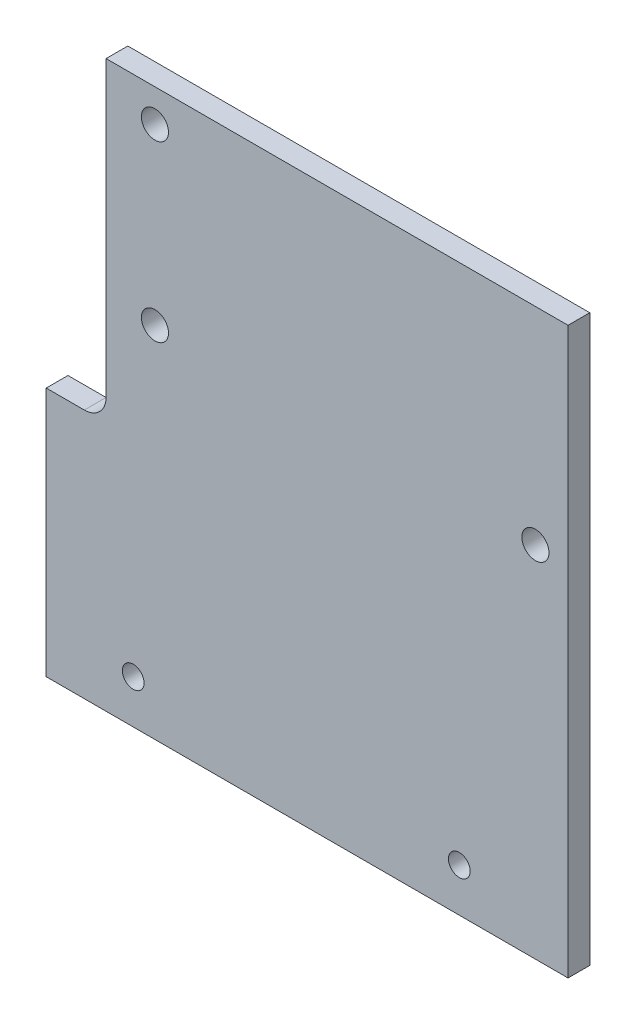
ISO-10303-21;
HEADER;
FILE_DESCRIPTION(('STEP AP214'),'2;1');
FILE_NAME('part.step','',(''),(''),'','','');
FILE_SCHEMA(('AUTOMOTIVE_DESIGN { 1 0 10303 214 1 1 1 1 }'));
ENDSEC;
DATA;
#1=APPLICATION_CONTEXT('core data for automotive mechanical design processes');
#2=APPLICATION_PROTOCOL_DEFINITION('international standard','automotive_design',2000,#1);
#3=PRODUCT_CONTEXT('',#1,'mechanical');
#4=PRODUCT('Part','Part','',(#3));
#5=PRODUCT_RELATED_PRODUCT_CATEGORY('part','',(#4));
#6=PRODUCT_DEFINITION_FORMATION('','',#4);
#7=PRODUCT_DEFINITION_CONTEXT('part definition',#1,'design');
#8=PRODUCT_DEFINITION('design','',#6,#7);
#9=PRODUCT_DEFINITION_SHAPE('','',#8);
#10=(LENGTH_UNIT() NAMED_UNIT(*) SI_UNIT(.MILLI.,.METRE.));
#11=(NAMED_UNIT(*) PLANE_ANGLE_UNIT() SI_UNIT($,.RADIAN.));
#12=(NAMED_UNIT(*) SI_UNIT($,.STERADIAN.) SOLID_ANGLE_UNIT());
#13=UNCERTAINTY_MEASURE_WITH_UNIT(LENGTH_MEASURE(1.E-05),#10,'distance_accuracy_value','');
#14=(GEOMETRIC_REPRESENTATION_CONTEXT(3) GLOBAL_UNCERTAINTY_ASSIGNED_CONTEXT((#13)) GLOBAL_UNIT_ASSIGNED_CONTEXT((#10,
#11,#12)) REPRESENTATION_CONTEXT('',''));
#15=CARTESIAN_POINT('',(0.,0.,0.));
#16=DIRECTION('',(0.,0.,1.));
#17=DIRECTION('',(1.,0.,0.));
#18=AXIS2_PLACEMENT_3D('',#15,#16,#17);
#19=CARTESIAN_POINT('',(0.,0.,6.35));
#20=DIRECTION('',(0.,0.,1.));
#21=DIRECTION('',(1.,0.,0.));
#22=AXIS2_PLACEMENT_3D('',#19,#20,#21);
#23=PLANE('',#22);
#24=CARTESIAN_POINT('',(25.4,12.7,6.35));
#25=DIRECTION('',(0.,0.,1.));
#26=DIRECTION('',(1.,0.,0.));
#27=AXIS2_PLACEMENT_3D('',#24,#25,#26);
#28=CIRCLE('',#27,3.175);
#29=CARTESIAN_POINT('',(28.575,12.7,6.35));
#30=VERTEX_POINT('',#29);
#31=EDGE_CURVE('E163',#30,#30,#28,.T.);
#32=ORIENTED_EDGE('',*,*,#31,.F.);
#33=EDGE_LOOP('',(#32));
#34=FACE_BOUND('',#33,.T.);
#35=CARTESIAN_POINT('',(31.75,104.775,6.35));
#36=DIRECTION('',(0.,0.,1.));
#37=DIRECTION('',(1.,0.,0.));
#38=AXIS2_PLACEMENT_3D('',#35,#36,#37);
#39=CIRCLE('',#38,3.96239999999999);
#40=CARTESIAN_POINT('',(35.7124,104.775,6.35));
#41=VERTEX_POINT('',#40);
#42=EDGE_CURVE('E151',#41,#41,#39,.T.);
#43=ORIENTED_EDGE('',*,*,#42,.F.);
#44=EDGE_LOOP('',(#43));
#45=FACE_BOUND('',#44,.T.);
#46=DIRECTION('',(0.,1.,0.));
#47=VECTOR('',#46,1.);
#48=CARTESIAN_POINT('',(152.4,0.,6.35));
#49=LINE('',#48,#47);
#50=CARTESIAN_POINT('',(152.4,0.,6.35));
#51=VERTEX_POINT('',#50);
#52=CARTESIAN_POINT('',(152.4,165.1,6.35));
#53=VERTEX_POINT('',#52);
#54=EDGE_CURVE('E102',#51,#53,#49,.T.);
#55=ORIENTED_EDGE('',*,*,#54,.T.);
#56=DIRECTION('',(-1.,0.,0.));
#57=VECTOR('',#56,1.);
#58=CARTESIAN_POINT('',(152.4,165.1,6.35));
#59=LINE('',#58,#57);
#60=CARTESIAN_POINT('',(17.4752,165.1,6.35));
#61=VERTEX_POINT('',#60);
#62=EDGE_CURVE('E92',#53,#61,#59,.T.);
#63=ORIENTED_EDGE('',*,*,#62,.T.);
#64=DIRECTION('',(0.,-1.,0.));
#65=VECTOR('',#64,1.);
#66=CARTESIAN_POINT('',(17.4752,165.1,6.35));
#67=LINE('',#66,#65);
#68=CARTESIAN_POINT('',(17.4752,79.375,6.35));
#69=VERTEX_POINT('',#68);
#70=EDGE_CURVE('E101',#61,#69,#67,.T.);
#71=ORIENTED_EDGE('',*,*,#70,.T.);
#72=CARTESIAN_POINT('',(11.1252,79.375,6.35));
#73=DIRECTION('',(0.,0.,1.));
#74=DIRECTION('',(1.,0.,0.));
#75=AXIS2_PLACEMENT_3D('',#72,#73,#74);
#76=CIRCLE('',#75,6.35);
#77=CARTESIAN_POINT('',(11.1252,73.025,6.35));
#78=VERTEX_POINT('',#77);
#79=EDGE_CURVE('E11',#69,#78,#76,.F.);
#80=ORIENTED_EDGE('',*,*,#79,.T.);
#81=DIRECTION('',(-1.,0.,0.));
#82=VECTOR('',#81,1.);
#83=CARTESIAN_POINT('',(17.4752,73.025,6.35));
#84=LINE('',#83,#82);
#85=CARTESIAN_POINT('',(0.,73.025,6.35));
#86=VERTEX_POINT('',#85);
#87=EDGE_CURVE('E145',#78,#86,#84,.T.);
#88=ORIENTED_EDGE('',*,*,#87,.T.);
#89=DIRECTION('',(0.,-1.,0.));
#90=VECTOR('',#89,1.);
#91=CARTESIAN_POINT('',(0.,73.025,6.35));
#92=LINE('',#91,#90);
#93=CARTESIAN_POINT('',(0.,0.,6.35));
#94=VERTEX_POINT('',#93);
#95=EDGE_CURVE('E143',#86,#94,#92,.T.);
#96=ORIENTED_EDGE('',*,*,#95,.T.);
#97=DIRECTION('',(1.,0.,0.));
#98=VECTOR('',#97,1.);
#99=CARTESIAN_POINT('',(0.,0.,6.35));
#100=LINE('',#99,#98);
#101=EDGE_CURVE('E107',#94,#51,#100,.T.);
#102=ORIENTED_EDGE('',*,*,#101,.T.);
#103=EDGE_LOOP('',(#55,#63,#71,#80,#88,#96,#102));
#104=FACE_BOUND('',#103,.T.);
#105=CARTESIAN_POINT('',(31.75,155.575,6.35));
#106=DIRECTION('',(0.,0.,1.));
#107=DIRECTION('',(1.,0.,0.));
#108=AXIS2_PLACEMENT_3D('',#105,#106,#107);
#109=CIRCLE('',#108,3.9624);
#110=CARTESIAN_POINT('',(35.7124,155.575,6.35));
#111=VERTEX_POINT('',#110);
#112=EDGE_CURVE('E141',#111,#111,#109,.T.);
#113=ORIENTED_EDGE('',*,*,#112,.F.);
#114=EDGE_LOOP('',(#113));
#115=FACE_BOUND('',#114,.T.);
#116=CARTESIAN_POINT('',(142.875,104.775,6.35));
#117=DIRECTION('',(0.,0.,1.));
#118=DIRECTION('',(1.,0.,0.));
#119=AXIS2_PLACEMENT_3D('',#116,#117,#118);
#120=CIRCLE('',#119,3.9624);
#121=CARTESIAN_POINT('',(146.8374,104.775,6.35));
#122=VERTEX_POINT('',#121);
#123=EDGE_CURVE('E157',#122,#122,#120,.T.);
#124=ORIENTED_EDGE('',*,*,#123,.F.);
#125=EDGE_LOOP('',(#124));
#126=FACE_BOUND('',#125,.T.);
#127=CARTESIAN_POINT('',(120.65,12.7,6.35));
#128=DIRECTION('',(0.,0.,1.));
#129=DIRECTION('',(1.,0.,0.));
#130=AXIS2_PLACEMENT_3D('',#127,#128,#129);
#131=CIRCLE('',#130,3.175);
#132=CARTESIAN_POINT('',(123.825,12.7,6.35));
#133=VERTEX_POINT('',#132);
#134=EDGE_CURVE('E169',#133,#133,#131,.T.);
#135=ORIENTED_EDGE('',*,*,#134,.F.);
#136=EDGE_LOOP('',(#135));
#137=FACE_BOUND('',#136,.T.);
#138=ADVANCED_FACE('F33',(#34,#45,#104,#115,#126,#137),#23,.T.);
#139=CARTESIAN_POINT('',(0.,0.,0.));
#140=DIRECTION('',(0.,0.,1.));
#141=DIRECTION('',(1.,0.,0.));
#142=AXIS2_PLACEMENT_3D('',#139,#140,#141);
#143=PLANE('',#142);
#144=CARTESIAN_POINT('',(25.4,12.7,0.));
#145=DIRECTION('',(0.,0.,1.));
#146=DIRECTION('',(1.,0.,0.));
#147=AXIS2_PLACEMENT_3D('',#144,#145,#146);
#148=CIRCLE('',#147,3.175);
#149=CARTESIAN_POINT('',(28.575,12.7,0.));
#150=VERTEX_POINT('',#149);
#151=EDGE_CURVE('E166',#150,#150,#148,.T.);
#152=ORIENTED_EDGE('',*,*,#151,.T.);
#153=EDGE_LOOP('',(#152));
#154=FACE_BOUND('',#153,.T.);
#155=CARTESIAN_POINT('',(31.75,104.775,0.));
#156=DIRECTION('',(0.,0.,1.));
#157=DIRECTION('',(1.,0.,0.));
#158=AXIS2_PLACEMENT_3D('',#155,#156,#157);
#159=CIRCLE('',#158,3.96239999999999);
#160=CARTESIAN_POINT('',(35.7124,104.775,0.));
#161=VERTEX_POINT('',#160);
#162=EDGE_CURVE('E154',#161,#161,#159,.T.);
#163=ORIENTED_EDGE('',*,*,#162,.T.);
#164=EDGE_LOOP('',(#163));
#165=FACE_BOUND('',#164,.T.);
#166=DIRECTION('',(0.,1.,0.));
#167=VECTOR('',#166,1.);
#168=CARTESIAN_POINT('',(152.4,0.,0.));
#169=LINE('',#168,#167);
#170=CARTESIAN_POINT('',(152.4,0.,0.));
#171=VERTEX_POINT('',#170);
#172=CARTESIAN_POINT('',(152.4,165.1,0.));
#173=VERTEX_POINT('',#172);
#174=EDGE_CURVE('E115',#171,#173,#169,.T.);
#175=ORIENTED_EDGE('',*,*,#174,.F.);
#176=DIRECTION('',(1.,0.,0.));
#177=VECTOR('',#176,1.);
#178=CARTESIAN_POINT('',(0.,0.,0.));
#179=LINE('',#178,#177);
#180=CARTESIAN_POINT('',(0.,0.,0.));
#181=VERTEX_POINT('',#180);
#182=EDGE_CURVE('E111',#181,#171,#179,.T.);
#183=ORIENTED_EDGE('',*,*,#182,.F.);
#184=DIRECTION('',(0.,-1.,0.));
#185=VECTOR('',#184,1.);
#186=CARTESIAN_POINT('',(0.,73.025,0.));
#187=LINE('',#186,#185);
#188=CARTESIAN_POINT('',(0.,73.025,0.));
#189=VERTEX_POINT('',#188);
#190=EDGE_CURVE('E132',#189,#181,#187,.T.);
#191=ORIENTED_EDGE('',*,*,#190,.F.);
#192=DIRECTION('',(-1.,0.,0.));
#193=VECTOR('',#192,1.);
#194=CARTESIAN_POINT('',(17.4752,73.025,0.));
#195=LINE('',#194,#193);
#196=CARTESIAN_POINT('',(11.1252,73.025,0.));
#197=VERTEX_POINT('',#196);
#198=EDGE_CURVE('E134',#197,#189,#195,.T.);
#199=ORIENTED_EDGE('',*,*,#198,.F.);
#200=CARTESIAN_POINT('',(11.1252,79.375,0.));
#201=DIRECTION('',(0.,0.,1.));
#202=DIRECTION('',(1.,0.,0.));
#203=AXIS2_PLACEMENT_3D('',#200,#201,#202);
#204=CIRCLE('',#203,6.35);
#205=CARTESIAN_POINT('',(17.4752,79.375,0.));
#206=VERTEX_POINT('',#205);
#207=EDGE_CURVE('E41',#197,#206,#204,.T.);
#208=ORIENTED_EDGE('',*,*,#207,.T.);
#209=DIRECTION('',(0.,-1.,0.));
#210=VECTOR('',#209,1.);
#211=CARTESIAN_POINT('',(17.4752,165.1,0.));
#212=LINE('',#211,#210);
#213=CARTESIAN_POINT('',(17.4752,165.1,0.));
#214=VERTEX_POINT('',#213);
#215=EDGE_CURVE('E136',#214,#206,#212,.T.);
#216=ORIENTED_EDGE('',*,*,#215,.F.);
#217=DIRECTION('',(-1.,0.,0.));
#218=VECTOR('',#217,1.);
#219=CARTESIAN_POINT('',(152.4,165.1,0.));
#220=LINE('',#219,#218);
#221=EDGE_CURVE('E138',#173,#214,#220,.T.);
#222=ORIENTED_EDGE('',*,*,#221,.F.);
#223=EDGE_LOOP('',(#175,#183,#191,#199,#208,#216,#222));
#224=FACE_BOUND('',#223,.T.);
#225=CARTESIAN_POINT('',(31.75,155.575,0.));
#226=DIRECTION('',(0.,0.,1.));
#227=DIRECTION('',(1.,0.,0.));
#228=AXIS2_PLACEMENT_3D('',#225,#226,#227);
#229=CIRCLE('',#228,3.9624);
#230=CARTESIAN_POINT('',(35.7124,155.575,0.));
#231=VERTEX_POINT('',#230);
#232=EDGE_CURVE('E148',#231,#231,#229,.T.);
#233=ORIENTED_EDGE('',*,*,#232,.T.);
#234=EDGE_LOOP('',(#233));
#235=FACE_BOUND('',#234,.T.);
#236=CARTESIAN_POINT('',(142.875,104.775,0.));
#237=DIRECTION('',(0.,0.,1.));
#238=DIRECTION('',(1.,0.,0.));
#239=AXIS2_PLACEMENT_3D('',#236,#237,#238);
#240=CIRCLE('',#239,3.9624);
#241=CARTESIAN_POINT('',(146.8374,104.775,0.));
#242=VERTEX_POINT('',#241);
#243=EDGE_CURVE('E160',#242,#242,#240,.T.);
#244=ORIENTED_EDGE('',*,*,#243,.T.);
#245=EDGE_LOOP('',(#244));
#246=FACE_BOUND('',#245,.T.);
#247=CARTESIAN_POINT('',(120.65,12.7,0.));
#248=DIRECTION('',(0.,0.,1.));
#249=DIRECTION('',(1.,0.,0.));
#250=AXIS2_PLACEMENT_3D('',#247,#248,#249);
#251=CIRCLE('',#250,3.175);
#252=CARTESIAN_POINT('',(123.825,12.7,0.));
#253=VERTEX_POINT('',#252);
#254=EDGE_CURVE('E172',#253,#253,#251,.T.);
#255=ORIENTED_EDGE('',*,*,#254,.T.);
#256=EDGE_LOOP('',(#255));
#257=FACE_BOUND('',#256,.T.);
#258=ADVANCED_FACE('F182',(#154,#165,#224,#235,#246,#257),#143,.F.);
#259=CARTESIAN_POINT('',(152.4,0.,6.35));
#260=DIRECTION('',(-1.,0.,0.));
#261=DIRECTION('',(0.,0.,1.));
#262=AXIS2_PLACEMENT_3D('',#259,#260,#261);
#263=PLANE('',#262);
#264=ORIENTED_EDGE('',*,*,#174,.T.);
#265=DIRECTION('',(0.,0.,-1.));
#266=VECTOR('',#265,1.);
#267=CARTESIAN_POINT('',(152.4,165.1,6.35));
#268=LINE('',#267,#266);
#269=EDGE_CURVE('E96',#53,#173,#268,.T.);
#270=ORIENTED_EDGE('',*,*,#269,.F.);
#271=ORIENTED_EDGE('',*,*,#54,.F.);
#272=DIRECTION('',(0.,0.,-1.));
#273=VECTOR('',#272,1.);
#274=CARTESIAN_POINT('',(152.4,0.,6.35));
#275=LINE('',#274,#273);
#276=EDGE_CURVE('E129',#51,#171,#275,.T.);
#277=ORIENTED_EDGE('',*,*,#276,.T.);
#278=EDGE_LOOP('',(#264,#270,#271,#277));
#279=FACE_BOUND('',#278,.T.);
#280=ADVANCED_FACE('F113',(#279),#263,.F.);
#281=CARTESIAN_POINT('',(152.4,165.1,6.35));
#282=DIRECTION('',(0.,-1.,0.));
#283=DIRECTION('',(1.,0.,0.));
#284=AXIS2_PLACEMENT_3D('',#281,#282,#283);
#285=PLANE('',#284);
#286=ORIENTED_EDGE('',*,*,#221,.T.);
#287=DIRECTION('',(0.,0.,-1.));
#288=VECTOR('',#287,1.);
#289=CARTESIAN_POINT('',(17.4752,165.1,6.35));
#290=LINE('',#289,#288);
#291=EDGE_CURVE('E99',#61,#214,#290,.T.);
#292=ORIENTED_EDGE('',*,*,#291,.F.);
#293=ORIENTED_EDGE('',*,*,#62,.F.);
#294=ORIENTED_EDGE('',*,*,#269,.T.);
#295=EDGE_LOOP('',(#286,#292,#293,#294));
#296=FACE_BOUND('',#295,.T.);
#297=ADVANCED_FACE('F94',(#296),#285,.F.);
#298=CARTESIAN_POINT('',(17.4752,165.1,6.35));
#299=DIRECTION('',(1.,0.,0.));
#300=DIRECTION('',(0.,1.,0.));
#301=AXIS2_PLACEMENT_3D('',#298,#299,#300);
#302=PLANE('',#301);
#303=ORIENTED_EDGE('',*,*,#215,.T.);
#304=DIRECTION('',(0.,0.,-1.));
#305=VECTOR('',#304,1.);
#306=CARTESIAN_POINT('',(17.4752,79.375,6.35));
#307=LINE('',#306,#305);
#308=EDGE_CURVE('E48',#206,#69,#307,.F.);
#309=ORIENTED_EDGE('',*,*,#308,.T.);
#310=ORIENTED_EDGE('',*,*,#70,.F.);
#311=ORIENTED_EDGE('',*,*,#291,.T.);
#312=EDGE_LOOP('',(#303,#309,#310,#311));
#313=FACE_BOUND('',#312,.T.);
#314=ADVANCED_FACE('F207',(#313),#302,.F.);
#315=CARTESIAN_POINT('',(17.4752,73.025,6.35));
#316=DIRECTION('',(0.,-1.,0.));
#317=DIRECTION('',(0.,0.,-1.));
#318=AXIS2_PLACEMENT_3D('',#315,#316,#317);
#319=PLANE('',#318);
#320=ORIENTED_EDGE('',*,*,#87,.F.);
#321=DIRECTION('',(0.,0.,-1.));
#322=VECTOR('',#321,1.);
#323=CARTESIAN_POINT('',(11.1252,73.025,0.));
#324=LINE('',#323,#322);
#325=EDGE_CURVE('E116',#78,#197,#324,.T.);
#326=ORIENTED_EDGE('',*,*,#325,.T.);
#327=ORIENTED_EDGE('',*,*,#198,.T.);
#328=DIRECTION('',(0.,0.,-1.));
#329=VECTOR('',#328,1.);
#330=CARTESIAN_POINT('',(0.,73.025,6.35));
#331=LINE('',#330,#329);
#332=EDGE_CURVE('E120',#86,#189,#331,.T.);
#333=ORIENTED_EDGE('',*,*,#332,.F.);
#334=EDGE_LOOP('',(#320,#326,#327,#333));
#335=FACE_BOUND('',#334,.T.);
#336=ADVANCED_FACE('F203',(#335),#319,.F.);
#337=CARTESIAN_POINT('',(0.,73.025,6.35));
#338=DIRECTION('',(1.,0.,0.));
#339=DIRECTION('',(0.,1.,0.));
#340=AXIS2_PLACEMENT_3D('',#337,#338,#339);
#341=PLANE('',#340);
#342=ORIENTED_EDGE('',*,*,#190,.T.);
#343=DIRECTION('',(0.,0.,-1.));
#344=VECTOR('',#343,1.);
#345=CARTESIAN_POINT('',(0.,0.,6.35));
#346=LINE('',#345,#344);
#347=EDGE_CURVE('E126',#94,#181,#346,.T.);
#348=ORIENTED_EDGE('',*,*,#347,.F.);
#349=ORIENTED_EDGE('',*,*,#95,.F.);
#350=ORIENTED_EDGE('',*,*,#332,.T.);
#351=EDGE_LOOP('',(#342,#348,#349,#350));
#352=FACE_BOUND('',#351,.T.);
#353=ADVANCED_FACE('F199',(#352),#341,.F.);
#354=CARTESIAN_POINT('',(0.,0.,6.35));
#355=DIRECTION('',(0.,1.,0.));
#356=DIRECTION('',(0.,0.,1.));
#357=AXIS2_PLACEMENT_3D('',#354,#355,#356);
#358=PLANE('',#357);
#359=ORIENTED_EDGE('',*,*,#182,.T.);
#360=ORIENTED_EDGE('',*,*,#276,.F.);
#361=ORIENTED_EDGE('',*,*,#101,.F.);
#362=ORIENTED_EDGE('',*,*,#347,.T.);
#363=EDGE_LOOP('',(#359,#360,#361,#362));
#364=FACE_BOUND('',#363,.T.);
#365=ADVANCED_FACE('F196',(#364),#358,.F.);
#366=CARTESIAN_POINT('',(31.75,155.575,6.35));
#367=DIRECTION('',(0.,0.,-1.));
#368=DIRECTION('',(-1.,0.,0.));
#369=AXIS2_PLACEMENT_3D('',#366,#367,#368);
#370=CYLINDRICAL_SURFACE('',#369,3.9624);
#371=ORIENTED_EDGE('',*,*,#112,.T.);
#372=EDGE_LOOP('',(#371));
#373=FACE_BOUND('',#372,.T.);
#374=ORIENTED_EDGE('',*,*,#232,.F.);
#375=EDGE_LOOP('',(#374));
#376=FACE_BOUND('',#375,.T.);
#377=ADVANCED_FACE('F193',(#373,#376),#370,.F.);
#378=CARTESIAN_POINT('',(31.75,104.775,6.35));
#379=DIRECTION('',(0.,0.,-1.));
#380=DIRECTION('',(-1.,0.,0.));
#381=AXIS2_PLACEMENT_3D('',#378,#379,#380);
#382=CYLINDRICAL_SURFACE('',#381,3.96239999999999);
#383=ORIENTED_EDGE('',*,*,#42,.T.);
#384=EDGE_LOOP('',(#383));
#385=FACE_BOUND('',#384,.T.);
#386=ORIENTED_EDGE('',*,*,#162,.F.);
#387=EDGE_LOOP('',(#386));
#388=FACE_BOUND('',#387,.T.);
#389=ADVANCED_FACE('F244',(#385,#388),#382,.F.);
#390=CARTESIAN_POINT('',(142.875,104.775,6.35));
#391=DIRECTION('',(0.,0.,-1.));
#392=DIRECTION('',(-1.,0.,0.));
#393=AXIS2_PLACEMENT_3D('',#390,#391,#392);
#394=CYLINDRICAL_SURFACE('',#393,3.9624);
#395=ORIENTED_EDGE('',*,*,#123,.T.);
#396=EDGE_LOOP('',(#395));
#397=FACE_BOUND('',#396,.T.);
#398=ORIENTED_EDGE('',*,*,#243,.F.);
#399=EDGE_LOOP('',(#398));
#400=FACE_BOUND('',#399,.T.);
#401=ADVANCED_FACE('F251',(#397,#400),#394,.F.);
#402=CARTESIAN_POINT('',(25.4,12.7,6.35));
#403=DIRECTION('',(0.,0.,-1.));
#404=DIRECTION('',(-1.,0.,0.));
#405=AXIS2_PLACEMENT_3D('',#402,#403,#404);
#406=CYLINDRICAL_SURFACE('',#405,3.175);
#407=ORIENTED_EDGE('',*,*,#31,.T.);
#408=EDGE_LOOP('',(#407));
#409=FACE_BOUND('',#408,.T.);
#410=ORIENTED_EDGE('',*,*,#151,.F.);
#411=EDGE_LOOP('',(#410));
#412=FACE_BOUND('',#411,.T.);
#413=ADVANCED_FACE('F258',(#409,#412),#406,.F.);
#414=CARTESIAN_POINT('',(120.65,12.7,6.35));
#415=DIRECTION('',(0.,0.,-1.));
#416=DIRECTION('',(-1.,0.,0.));
#417=AXIS2_PLACEMENT_3D('',#414,#415,#416);
#418=CYLINDRICAL_SURFACE('',#417,3.175);
#419=ORIENTED_EDGE('',*,*,#134,.T.);
#420=EDGE_LOOP('',(#419));
#421=FACE_BOUND('',#420,.T.);
#422=ORIENTED_EDGE('',*,*,#254,.F.);
#423=EDGE_LOOP('',(#422));
#424=FACE_BOUND('',#423,.T.);
#425=ADVANCED_FACE('F178',(#421,#424),#418,.F.);
#426=CARTESIAN_POINT('',(11.1252,79.375,6.35));
#427=DIRECTION('',(0.,0.,1.));
#428=DIRECTION('',(1.,0.,0.));
#429=AXIS2_PLACEMENT_3D('',#426,#427,#428);
#430=CYLINDRICAL_SURFACE('',#429,6.35);
#431=ORIENTED_EDGE('',*,*,#79,.F.);
#432=ORIENTED_EDGE('',*,*,#308,.F.);
#433=ORIENTED_EDGE('',*,*,#207,.F.);
#434=ORIENTED_EDGE('',*,*,#325,.F.);
#435=EDGE_LOOP('',(#431,#432,#433,#434));
#436=FACE_BOUND('',#435,.T.);
#437=ADVANCED_FACE('F35',(#436),#430,.F.);
#438=CLOSED_SHELL('',(#138,#258,#280,#297,#314,#336,#353,#365,#377,#389,#401,#413,#425,#437));
#439=MANIFOLD_SOLID_BREP('B2',#438);
#440=ADVANCED_BREP_SHAPE_REPRESENTATION('',(#18,#439),#14);
#441=SHAPE_DEFINITION_REPRESENTATION(#9,#440);
ENDSEC;
END-ISO-10303-21;
